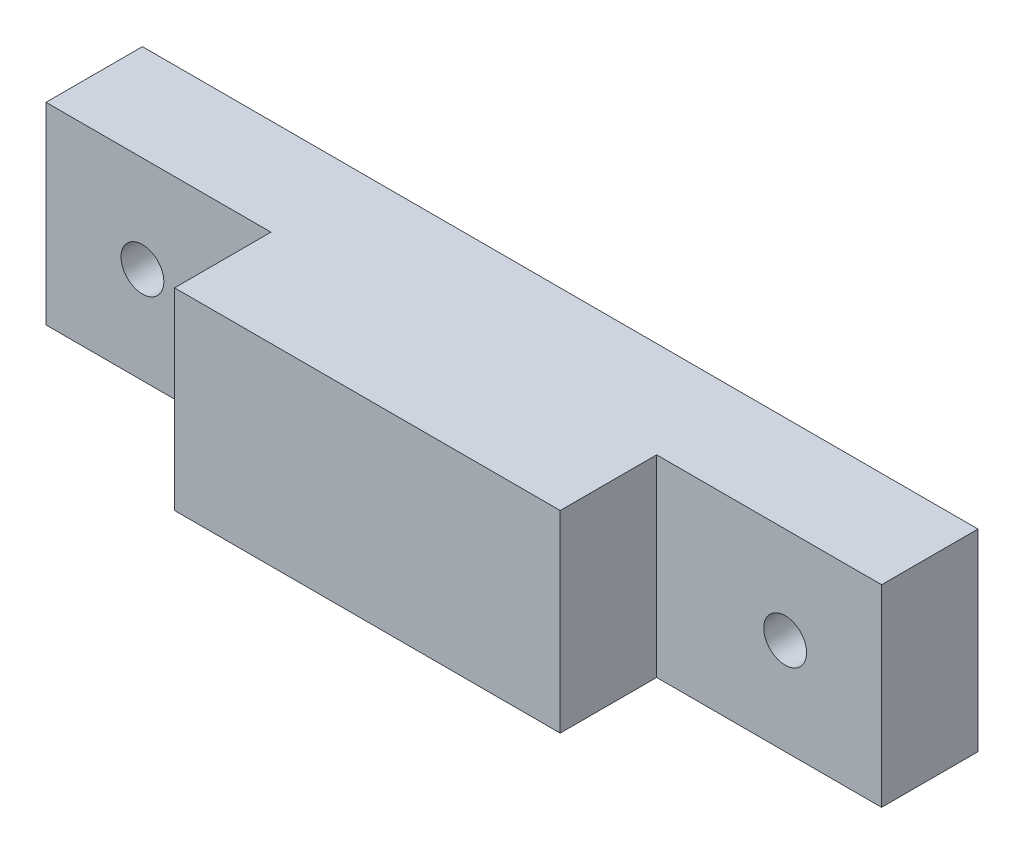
ISO-10303-21;
HEADER;
FILE_DESCRIPTION(('STEP AP214'),'2;1');
FILE_NAME('part.step','',(''),(''),'','','');
FILE_SCHEMA(('AUTOMOTIVE_DESIGN { 1 0 10303 214 1 1 1 1 }'));
ENDSEC;
DATA;
#1=APPLICATION_CONTEXT('core data for automotive mechanical design processes');
#2=APPLICATION_PROTOCOL_DEFINITION('international standard','automotive_design',2000,#1);
#3=PRODUCT_CONTEXT('',#1,'mechanical');
#4=PRODUCT('Part','Part','',(#3));
#5=PRODUCT_RELATED_PRODUCT_CATEGORY('part','',(#4));
#6=PRODUCT_DEFINITION_FORMATION('','',#4);
#7=PRODUCT_DEFINITION_CONTEXT('part definition',#1,'design');
#8=PRODUCT_DEFINITION('design','',#6,#7);
#9=PRODUCT_DEFINITION_SHAPE('','',#8);
#10=(LENGTH_UNIT() NAMED_UNIT(*) SI_UNIT(.MILLI.,.METRE.));
#11=(NAMED_UNIT(*) PLANE_ANGLE_UNIT() SI_UNIT($,.RADIAN.));
#12=(NAMED_UNIT(*) SI_UNIT($,.STERADIAN.) SOLID_ANGLE_UNIT());
#13=UNCERTAINTY_MEASURE_WITH_UNIT(LENGTH_MEASURE(1.E-05),#10,'distance_accuracy_value','');
#14=(GEOMETRIC_REPRESENTATION_CONTEXT(3) GLOBAL_UNCERTAINTY_ASSIGNED_CONTEXT((#13)) GLOBAL_UNIT_ASSIGNED_CONTEXT((#10,
#11,#12)) REPRESENTATION_CONTEXT('',''));
#15=CARTESIAN_POINT('',(0.,0.,0.));
#16=DIRECTION('',(0.,0.,1.));
#17=DIRECTION('',(1.,0.,0.));
#18=AXIS2_PLACEMENT_3D('',#15,#16,#17);
#19=CARTESIAN_POINT('',(39.,0.,9.));
#20=DIRECTION('',(-1.,0.,0.));
#21=DIRECTION('',(0.,0.,1.));
#22=AXIS2_PLACEMENT_3D('',#19,#20,#21);
#23=PLANE('',#22);
#24=DIRECTION('',(0.,1.,0.));
#25=VECTOR('',#24,1.);
#26=CARTESIAN_POINT('',(39.,0.,4.5));
#27=LINE('',#26,#25);
#28=CARTESIAN_POINT('',(39.,0.,4.5));
#29=VERTEX_POINT('',#28);
#30=CARTESIAN_POINT('',(39.,9.,4.5));
#31=VERTEX_POINT('',#30);
#32=EDGE_CURVE('E96',#29,#31,#27,.T.);
#33=ORIENTED_EDGE('',*,*,#32,.F.);
#34=DIRECTION('',(0.,0.,-1.));
#35=VECTOR('',#34,1.);
#36=CARTESIAN_POINT('',(39.,0.,9.));
#37=LINE('',#36,#35);
#38=CARTESIAN_POINT('',(39.,0.,0.));
#39=VERTEX_POINT('',#38);
#40=EDGE_CURVE('E39',#29,#39,#37,.T.);
#41=ORIENTED_EDGE('',*,*,#40,.T.);
#42=DIRECTION('',(0.,1.,0.));
#43=VECTOR('',#42,1.);
#44=CARTESIAN_POINT('',(39.,0.,0.));
#45=LINE('',#44,#43);
#46=CARTESIAN_POINT('',(39.,9.,0.));
#47=VERTEX_POINT('',#46);
#48=EDGE_CURVE('E117',#39,#47,#45,.T.);
#49=ORIENTED_EDGE('',*,*,#48,.T.);
#50=DIRECTION('',(0.,0.,-1.));
#51=VECTOR('',#50,1.);
#52=CARTESIAN_POINT('',(39.,9.,9.));
#53=LINE('',#52,#51);
#54=EDGE_CURVE('E112',#31,#47,#53,.T.);
#55=ORIENTED_EDGE('',*,*,#54,.F.);
#56=EDGE_LOOP('',(#33,#41,#49,#55));
#57=FACE_BOUND('',#56,.T.);
#58=ADVANCED_FACE('F31',(#57),#23,.F.);
#59=CARTESIAN_POINT('',(0.,0.,9.));
#60=DIRECTION('',(1.,0.,0.));
#61=DIRECTION('',(0.,0.,-1.));
#62=AXIS2_PLACEMENT_3D('',#59,#60,#61);
#63=PLANE('',#62);
#64=DIRECTION('',(0.,0.,-1.));
#65=VECTOR('',#64,1.);
#66=CARTESIAN_POINT('',(0.,0.,9.));
#67=LINE('',#66,#65);
#68=CARTESIAN_POINT('',(0.,0.,4.5));
#69=VERTEX_POINT('',#68);
#70=CARTESIAN_POINT('',(0.,0.,0.));
#71=VERTEX_POINT('',#70);
#72=EDGE_CURVE('E11',#69,#71,#67,.T.);
#73=ORIENTED_EDGE('',*,*,#72,.F.);
#74=DIRECTION('',(0.,-1.,0.));
#75=VECTOR('',#74,1.);
#76=CARTESIAN_POINT('',(0.,0.,4.5));
#77=LINE('',#76,#75);
#78=CARTESIAN_POINT('',(0.,9.,4.5));
#79=VERTEX_POINT('',#78);
#80=EDGE_CURVE('E144',#79,#69,#77,.T.);
#81=ORIENTED_EDGE('',*,*,#80,.F.);
#82=DIRECTION('',(0.,0.,-1.));
#83=VECTOR('',#82,1.);
#84=CARTESIAN_POINT('',(0.,9.,9.));
#85=LINE('',#84,#83);
#86=CARTESIAN_POINT('',(0.,9.,0.));
#87=VERTEX_POINT('',#86);
#88=EDGE_CURVE('E119',#79,#87,#85,.T.);
#89=ORIENTED_EDGE('',*,*,#88,.T.);
#90=DIRECTION('',(0.,-1.,0.));
#91=VECTOR('',#90,1.);
#92=CARTESIAN_POINT('',(0.,0.,0.));
#93=LINE('',#92,#91);
#94=EDGE_CURVE('E131',#87,#71,#93,.T.);
#95=ORIENTED_EDGE('',*,*,#94,.T.);
#96=EDGE_LOOP('',(#73,#81,#89,#95));
#97=FACE_BOUND('',#96,.T.);
#98=ADVANCED_FACE('F33',(#97),#63,.F.);
#99=CARTESIAN_POINT('',(0.,0.,9.));
#100=DIRECTION('',(0.,1.,0.));
#101=DIRECTION('',(0.,0.,1.));
#102=AXIS2_PLACEMENT_3D('',#99,#100,#101);
#103=PLANE('',#102);
#104=DIRECTION('',(1.,0.,0.));
#105=VECTOR('',#104,1.);
#106=CARTESIAN_POINT('',(39.,0.,4.5));
#107=LINE('',#106,#105);
#108=CARTESIAN_POINT('',(28.5,0.,4.5));
#109=VERTEX_POINT('',#108);
#110=EDGE_CURVE('E102',#109,#29,#107,.T.);
#111=ORIENTED_EDGE('',*,*,#110,.F.);
#112=DIRECTION('',(0.,0.,1.));
#113=VECTOR('',#112,1.);
#114=CARTESIAN_POINT('',(28.5,0.,4.5));
#115=LINE('',#114,#113);
#116=CARTESIAN_POINT('',(28.5,0.,9.));
#117=VERTEX_POINT('',#116);
#118=EDGE_CURVE('E145',#109,#117,#115,.T.);
#119=ORIENTED_EDGE('',*,*,#118,.T.);
#120=DIRECTION('',(1.,0.,0.));
#121=VECTOR('',#120,1.);
#122=CARTESIAN_POINT('',(0.,0.,9.));
#123=LINE('',#122,#121);
#124=CARTESIAN_POINT('',(10.5,0.,9.));
#125=VERTEX_POINT('',#124);
#126=EDGE_CURVE('E126',#125,#117,#123,.T.);
#127=ORIENTED_EDGE('',*,*,#126,.F.);
#128=DIRECTION('',(0.,0.,1.));
#129=VECTOR('',#128,1.);
#130=CARTESIAN_POINT('',(10.5,0.,4.5));
#131=LINE('',#130,#129);
#132=CARTESIAN_POINT('',(10.5,0.,4.5));
#133=VERTEX_POINT('',#132);
#134=EDGE_CURVE('E54',#133,#125,#131,.T.);
#135=ORIENTED_EDGE('',*,*,#134,.F.);
#136=DIRECTION('',(1.,0.,0.));
#137=VECTOR('',#136,1.);
#138=CARTESIAN_POINT('',(0.,0.,4.5));
#139=LINE('',#138,#137);
#140=EDGE_CURVE('E150',#69,#133,#139,.T.);
#141=ORIENTED_EDGE('',*,*,#140,.F.);
#142=ORIENTED_EDGE('',*,*,#72,.T.);
#143=DIRECTION('',(1.,0.,0.));
#144=VECTOR('',#143,1.);
#145=CARTESIAN_POINT('',(0.,0.,0.));
#146=LINE('',#145,#144);
#147=EDGE_CURVE('E128',#71,#39,#146,.T.);
#148=ORIENTED_EDGE('',*,*,#147,.T.);
#149=ORIENTED_EDGE('',*,*,#40,.F.);
#150=EDGE_LOOP('',(#111,#119,#127,#135,#141,#142,#148,#149));
#151=FACE_BOUND('',#150,.T.);
#152=ADVANCED_FACE('F199',(#151),#103,.F.);
#153=CARTESIAN_POINT('',(0.,9.,9.));
#154=DIRECTION('',(0.,-1.,0.));
#155=DIRECTION('',(0.,0.,-1.));
#156=AXIS2_PLACEMENT_3D('',#153,#154,#155);
#157=PLANE('',#156);
#158=DIRECTION('',(-1.,0.,0.));
#159=VECTOR('',#158,1.);
#160=CARTESIAN_POINT('',(0.,9.,9.));
#161=LINE('',#160,#159);
#162=CARTESIAN_POINT('',(28.5,9.,9.));
#163=VERTEX_POINT('',#162);
#164=CARTESIAN_POINT('',(10.5,9.,9.));
#165=VERTEX_POINT('',#164);
#166=EDGE_CURVE('E121',#163,#165,#161,.T.);
#167=ORIENTED_EDGE('',*,*,#166,.F.);
#168=DIRECTION('',(0.,0.,1.));
#169=VECTOR('',#168,1.);
#170=CARTESIAN_POINT('',(28.5,9.,4.5));
#171=LINE('',#170,#169);
#172=CARTESIAN_POINT('',(28.5,9.,4.5));
#173=VERTEX_POINT('',#172);
#174=EDGE_CURVE('E46',#173,#163,#171,.T.);
#175=ORIENTED_EDGE('',*,*,#174,.F.);
#176=DIRECTION('',(-1.,0.,0.));
#177=VECTOR('',#176,1.);
#178=CARTESIAN_POINT('',(39.,9.,4.5));
#179=LINE('',#178,#177);
#180=EDGE_CURVE('E100',#31,#173,#179,.T.);
#181=ORIENTED_EDGE('',*,*,#180,.F.);
#182=ORIENTED_EDGE('',*,*,#54,.T.);
#183=DIRECTION('',(-1.,0.,0.));
#184=VECTOR('',#183,1.);
#185=CARTESIAN_POINT('',(0.,9.,0.));
#186=LINE('',#185,#184);
#187=EDGE_CURVE('E124',#47,#87,#186,.T.);
#188=ORIENTED_EDGE('',*,*,#187,.T.);
#189=ORIENTED_EDGE('',*,*,#88,.F.);
#190=DIRECTION('',(-1.,0.,0.));
#191=VECTOR('',#190,1.);
#192=CARTESIAN_POINT('',(0.,9.,4.5));
#193=LINE('',#192,#191);
#194=CARTESIAN_POINT('',(10.5,9.,4.5));
#195=VERTEX_POINT('',#194);
#196=EDGE_CURVE('E139',#195,#79,#193,.T.);
#197=ORIENTED_EDGE('',*,*,#196,.F.);
#198=DIRECTION('',(0.,0.,1.));
#199=VECTOR('',#198,1.);
#200=CARTESIAN_POINT('',(10.5,9.,4.5));
#201=LINE('',#200,#199);
#202=EDGE_CURVE('E134',#195,#165,#201,.T.);
#203=ORIENTED_EDGE('',*,*,#202,.T.);
#204=EDGE_LOOP('',(#167,#175,#181,#182,#188,#189,#197,#203));
#205=FACE_BOUND('',#204,.T.);
#206=ADVANCED_FACE('F110',(#205),#157,.F.);
#207=CARTESIAN_POINT('',(0.,9.,9.));
#208=DIRECTION('',(0.,0.,-1.));
#209=DIRECTION('',(-1.,0.,0.));
#210=AXIS2_PLACEMENT_3D('',#207,#208,#209);
#211=PLANE('',#210);
#212=ORIENTED_EDGE('',*,*,#126,.T.);
#213=DIRECTION('',(0.,-1.,0.));
#214=VECTOR('',#213,1.);
#215=CARTESIAN_POINT('',(28.5,0.,9.));
#216=LINE('',#215,#214);
#217=EDGE_CURVE('E106',#163,#117,#216,.T.);
#218=ORIENTED_EDGE('',*,*,#217,.F.);
#219=ORIENTED_EDGE('',*,*,#166,.T.);
#220=DIRECTION('',(0.,1.,0.));
#221=VECTOR('',#220,1.);
#222=CARTESIAN_POINT('',(10.5,0.,9.));
#223=LINE('',#222,#221);
#224=EDGE_CURVE('E142',#125,#165,#223,.T.);
#225=ORIENTED_EDGE('',*,*,#224,.F.);
#226=EDGE_LOOP('',(#212,#218,#219,#225));
#227=FACE_BOUND('',#226,.T.);
#228=ADVANCED_FACE('F208',(#227),#211,.F.);
#229=CARTESIAN_POINT('',(0.,9.,0.));
#230=DIRECTION('',(0.,0.,-1.));
#231=DIRECTION('',(-1.,0.,0.));
#232=AXIS2_PLACEMENT_3D('',#229,#230,#231);
#233=PLANE('',#232);
#234=CARTESIAN_POINT('',(34.5,4.5,0.));
#235=DIRECTION('',(0.,0.,1.));
#236=DIRECTION('',(1.,0.,0.));
#237=AXIS2_PLACEMENT_3D('',#234,#235,#236);
#238=CIRCLE('',#237,0.999999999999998);
#239=CARTESIAN_POINT('',(35.5,4.5,0.));
#240=VERTEX_POINT('',#239);
#241=EDGE_CURVE('E164',#240,#240,#238,.T.);
#242=ORIENTED_EDGE('',*,*,#241,.T.);
#243=EDGE_LOOP('',(#242));
#244=FACE_BOUND('',#243,.T.);
#245=CARTESIAN_POINT('',(4.5,4.5,0.));
#246=DIRECTION('',(0.,0.,1.));
#247=DIRECTION('',(1.,0.,0.));
#248=AXIS2_PLACEMENT_3D('',#245,#246,#247);
#249=CIRCLE('',#248,1.);
#250=CARTESIAN_POINT('',(5.5,4.5,0.));
#251=VERTEX_POINT('',#250);
#252=EDGE_CURVE('E158',#251,#251,#249,.T.);
#253=ORIENTED_EDGE('',*,*,#252,.T.);
#254=EDGE_LOOP('',(#253));
#255=FACE_BOUND('',#254,.T.);
#256=ORIENTED_EDGE('',*,*,#94,.F.);
#257=ORIENTED_EDGE('',*,*,#187,.F.);
#258=ORIENTED_EDGE('',*,*,#48,.F.);
#259=ORIENTED_EDGE('',*,*,#147,.F.);
#260=EDGE_LOOP('',(#256,#257,#258,#259));
#261=FACE_BOUND('',#260,.T.);
#262=ADVANCED_FACE('F173',(#244,#255,#261),#233,.T.);
#263=CARTESIAN_POINT('',(10.5,0.,4.5));
#264=DIRECTION('',(1.,0.,0.));
#265=DIRECTION('',(0.,0.,-1.));
#266=AXIS2_PLACEMENT_3D('',#263,#264,#265);
#267=PLANE('',#266);
#268=ORIENTED_EDGE('',*,*,#224,.T.);
#269=ORIENTED_EDGE('',*,*,#202,.F.);
#270=DIRECTION('',(0.,1.,0.));
#271=VECTOR('',#270,1.);
#272=CARTESIAN_POINT('',(10.5,0.,4.5));
#273=LINE('',#272,#271);
#274=EDGE_CURVE('E147',#133,#195,#273,.T.);
#275=ORIENTED_EDGE('',*,*,#274,.F.);
#276=ORIENTED_EDGE('',*,*,#134,.T.);
#277=EDGE_LOOP('',(#268,#269,#275,#276));
#278=FACE_BOUND('',#277,.T.);
#279=ADVANCED_FACE('F220',(#278),#267,.F.);
#280=CARTESIAN_POINT('',(0.,9.,4.5));
#281=DIRECTION('',(0.,0.,-1.));
#282=DIRECTION('',(-1.,0.,0.));
#283=AXIS2_PLACEMENT_3D('',#280,#281,#282);
#284=PLANE('',#283);
#285=CARTESIAN_POINT('',(4.5,4.5,4.5));
#286=DIRECTION('',(0.,0.,1.));
#287=DIRECTION('',(1.,0.,0.));
#288=AXIS2_PLACEMENT_3D('',#285,#286,#287);
#289=CIRCLE('',#288,1.);
#290=CARTESIAN_POINT('',(5.5,4.5,4.5));
#291=VERTEX_POINT('',#290);
#292=EDGE_CURVE('E161',#291,#291,#289,.T.);
#293=ORIENTED_EDGE('',*,*,#292,.F.);
#294=EDGE_LOOP('',(#293));
#295=FACE_BOUND('',#294,.T.);
#296=ORIENTED_EDGE('',*,*,#80,.T.);
#297=ORIENTED_EDGE('',*,*,#140,.T.);
#298=ORIENTED_EDGE('',*,*,#274,.T.);
#299=ORIENTED_EDGE('',*,*,#196,.T.);
#300=EDGE_LOOP('',(#296,#297,#298,#299));
#301=FACE_BOUND('',#300,.T.);
#302=ADVANCED_FACE('F192',(#295,#301),#284,.F.);
#303=CARTESIAN_POINT('',(28.5,0.,4.5));
#304=DIRECTION('',(-1.,0.,0.));
#305=DIRECTION('',(0.,0.,1.));
#306=AXIS2_PLACEMENT_3D('',#303,#304,#305);
#307=PLANE('',#306);
#308=ORIENTED_EDGE('',*,*,#217,.T.);
#309=ORIENTED_EDGE('',*,*,#118,.F.);
#310=DIRECTION('',(0.,-1.,0.));
#311=VECTOR('',#310,1.);
#312=CARTESIAN_POINT('',(28.5,0.,4.5));
#313=LINE('',#312,#311);
#314=EDGE_CURVE('E114',#173,#109,#313,.T.);
#315=ORIENTED_EDGE('',*,*,#314,.F.);
#316=ORIENTED_EDGE('',*,*,#174,.T.);
#317=EDGE_LOOP('',(#308,#309,#315,#316));
#318=FACE_BOUND('',#317,.T.);
#319=ADVANCED_FACE('F184',(#318),#307,.F.);
#320=CARTESIAN_POINT('',(39.,9.,4.5));
#321=DIRECTION('',(0.,0.,1.));
#322=DIRECTION('',(1.,0.,0.));
#323=AXIS2_PLACEMENT_3D('',#320,#321,#322);
#324=PLANE('',#323);
#325=CARTESIAN_POINT('',(34.5,4.5,4.5));
#326=DIRECTION('',(0.,0.,1.));
#327=DIRECTION('',(1.,0.,0.));
#328=AXIS2_PLACEMENT_3D('',#325,#326,#327);
#329=CIRCLE('',#328,0.999999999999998);
#330=CARTESIAN_POINT('',(35.5,4.5,4.5));
#331=VERTEX_POINT('',#330);
#332=EDGE_CURVE('E167',#331,#331,#329,.T.);
#333=ORIENTED_EDGE('',*,*,#332,.F.);
#334=EDGE_LOOP('',(#333));
#335=FACE_BOUND('',#334,.T.);
#336=ORIENTED_EDGE('',*,*,#32,.T.);
#337=ORIENTED_EDGE('',*,*,#180,.T.);
#338=ORIENTED_EDGE('',*,*,#314,.T.);
#339=ORIENTED_EDGE('',*,*,#110,.T.);
#340=EDGE_LOOP('',(#336,#337,#338,#339));
#341=FACE_BOUND('',#340,.T.);
#342=ADVANCED_FACE('F98',(#335,#341),#324,.T.);
#343=CARTESIAN_POINT('',(4.5,4.5,0.));
#344=DIRECTION('',(0.,0.,1.));
#345=DIRECTION('',(1.,0.,0.));
#346=AXIS2_PLACEMENT_3D('',#343,#344,#345);
#347=CYLINDRICAL_SURFACE('',#346,1.);
#348=ORIENTED_EDGE('',*,*,#252,.F.);
#349=EDGE_LOOP('',(#348));
#350=FACE_BOUND('',#349,.T.);
#351=ORIENTED_EDGE('',*,*,#292,.T.);
#352=EDGE_LOOP('',(#351));
#353=FACE_BOUND('',#352,.T.);
#354=ADVANCED_FACE('F179',(#350,#353),#347,.F.);
#355=CARTESIAN_POINT('',(34.5,4.5,0.));
#356=DIRECTION('',(0.,0.,1.));
#357=DIRECTION('',(1.,0.,0.));
#358=AXIS2_PLACEMENT_3D('',#355,#356,#357);
#359=CYLINDRICAL_SURFACE('',#358,0.999999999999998);
#360=ORIENTED_EDGE('',*,*,#241,.F.);
#361=EDGE_LOOP('',(#360));
#362=FACE_BOUND('',#361,.T.);
#363=ORIENTED_EDGE('',*,*,#332,.T.);
#364=EDGE_LOOP('',(#363));
#365=FACE_BOUND('',#364,.T.);
#366=ADVANCED_FACE('F176',(#362,#365),#359,.F.);
#367=CLOSED_SHELL('',(#58,#98,#152,#206,#228,#262,#279,#302,#319,#342,#354,#366));
#368=MANIFOLD_SOLID_BREP('B2',#367);
#369=ADVANCED_BREP_SHAPE_REPRESENTATION('',(#18,#368),#14);
#370=SHAPE_DEFINITION_REPRESENTATION(#9,#369);
ENDSEC;
END-ISO-10303-21;
